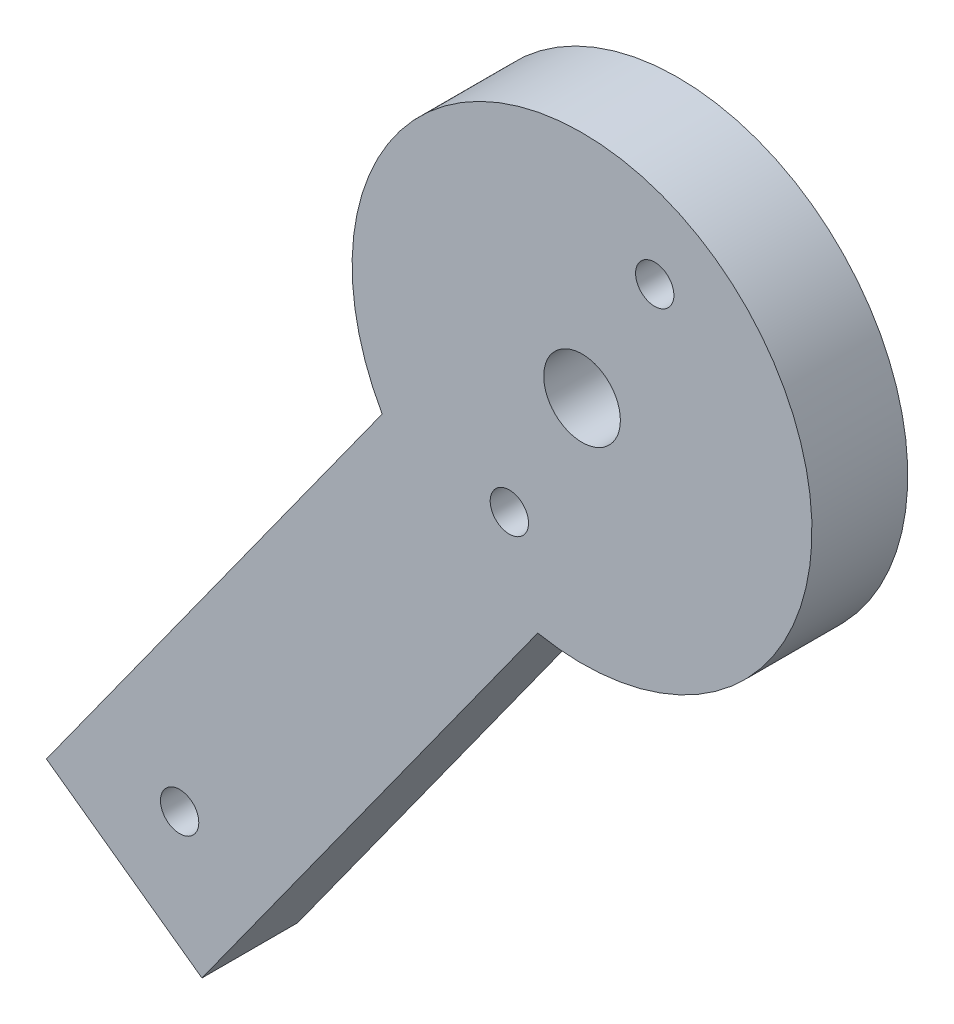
from build123d import *

# Parameters (mm, degrees)
BOSS_EXTRUDE1_DEPTH = 5
SKETCH2_R           = 2
SKETCH2_R_2         = 1
CUT_EXTRUDE1_DEPTH  = 5
SKETCH3_R           = 1
CUT_EXTRUDE2_DEPTH  = 5


with BuildPart() as part:
    # Sketch1 → Boss-Extrude1 (new body)
    with BuildSketch(Plane.XY):
        with BuildLine():
            Line((-10.430189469, -5.933904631), (-27.953190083, -30.284355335))
            Line((-27.953190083, -30.284355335), (-19.836373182, -36.125355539))
            Line((-19.836373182, -36.125355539), (-2.313372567, -11.774904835))
            ThreePointArc((-2.313372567, -11.774904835), (7.009202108, 9.740182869), (-10.430189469, -5.933904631))
        make_face()
    extrude(amount=BOSS_EXTRUDE1_DEPTH)

    # Sketch2 → Cut-Extrude1 (cut)
    with BuildSketch(Plane.XY.offset(5)):
        Circle(SKETCH2_R)
        with Locations((-21.001549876, -29.184339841)):
            Circle(SKETCH2_R_2)
    extrude(amount=-CUT_EXTRUDE1_DEPTH, mode=Mode.SUBTRACT)

    # Sketch3 → Cut-Extrude2 (cut)
    with BuildSketch(Plane.XY.offset(5)):
        with Locations((3.792976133, 7.043673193)):
            Circle(SKETCH3_R)
        with Locations((-3.792976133, -7.043673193)):
            Circle(SKETCH3_R)
    extrude(amount=-CUT_EXTRUDE2_DEPTH, mode=Mode.SUBTRACT)


solid = part.part
